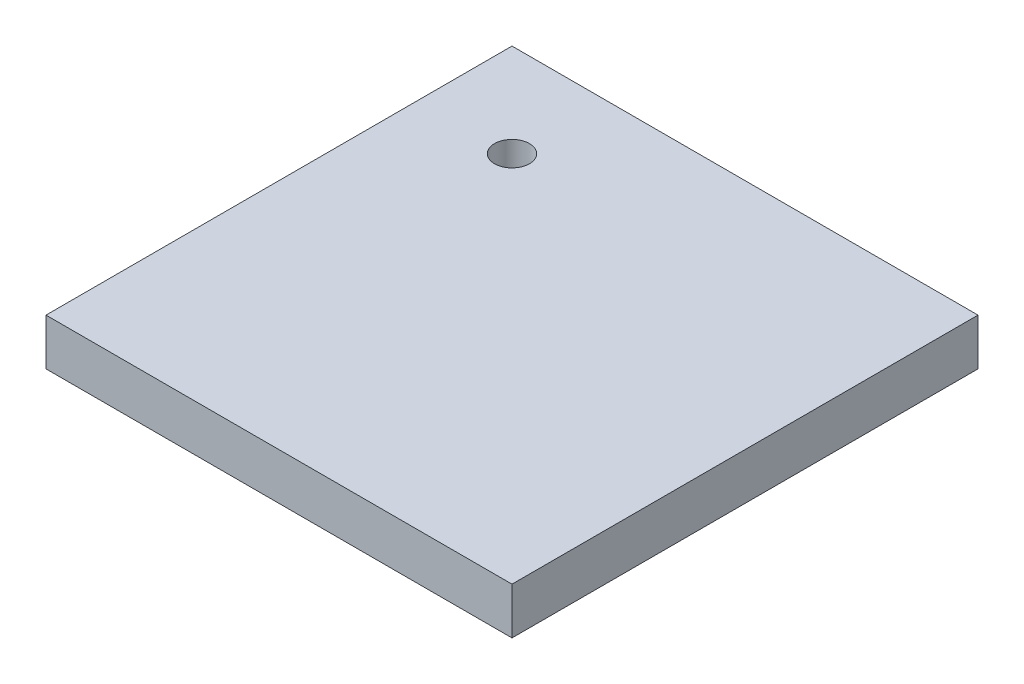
from build123d import *

# Parameters (mm, degrees)
SKETCH1_W                      = 100
SKETCH1_H                      = 100
EXTRUDE1_DEPTH                 = 10
F_7_5_7_5_DIAMETER_HOLE1_D     = 7.5
F_7_5_7_5_DIAMETER_HOLE1_DEPTH = 10
F_7_5_7_5_DIAMETER_HOLE1_TIP   = 2.253227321


with BuildPart() as part:
    # Sketch1 → Extrude1 (new body)
    with BuildSketch(Plane(origin=(0, 0, 0), x_dir=(1, 0, 0), z_dir=(0, 1, 0))):
        with Locations((50, 50)):
            Rectangle(SKETCH1_W, SKETCH1_H)
    extrude(amount=EXTRUDE1_DEPTH)

    # 7.5 _7.5_ Diameter Hole1
    with Locations(Plane(origin=(20, 10, -80), x_dir=(0, 0, 1), z_dir=(0, 1, 0))):
        with Locations((0, 0)):
            Hole(F_7_5_7_5_DIAMETER_HOLE1_D / 2, depth=F_7_5_7_5_DIAMETER_HOLE1_DEPTH)
            with Locations((0, 0, -(F_7_5_7_5_DIAMETER_HOLE1_DEPTH + F_7_5_7_5_DIAMETER_HOLE1_TIP / 2))):  # 118° drill point
                Cone(0, F_7_5_7_5_DIAMETER_HOLE1_D / 2, F_7_5_7_5_DIAMETER_HOLE1_TIP, mode=Mode.SUBTRACT)


solid = part.part
